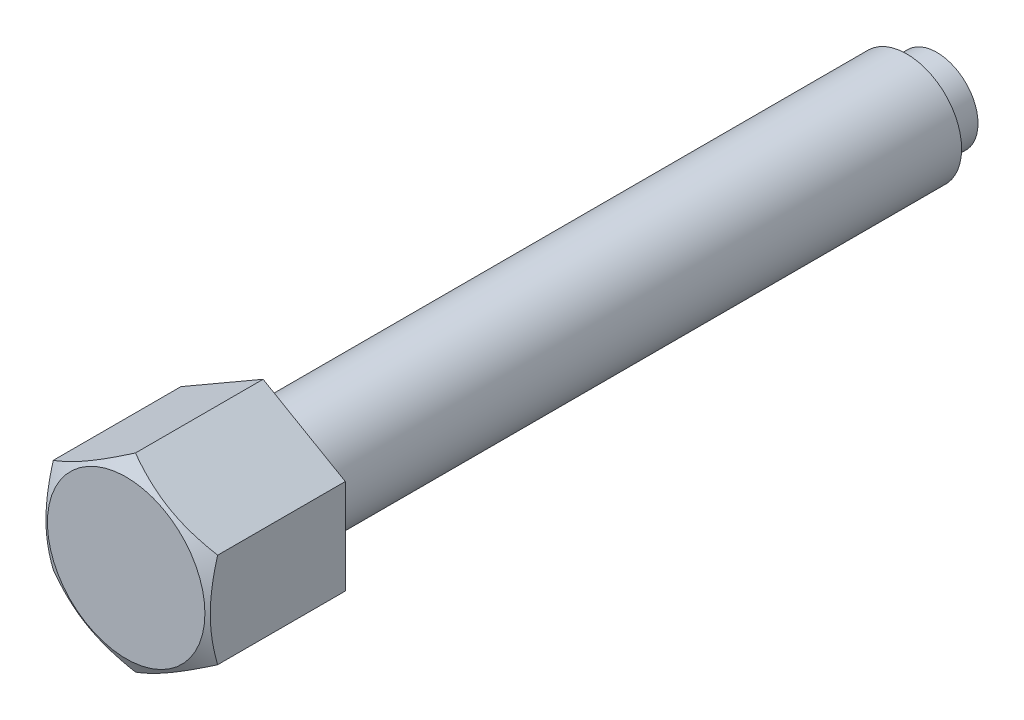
ISO-10303-21;
HEADER;
FILE_DESCRIPTION(('STEP AP214'),'2;1');
FILE_NAME('part.step','',(''),(''),'','','');
FILE_SCHEMA(('AUTOMOTIVE_DESIGN { 1 0 10303 214 1 1 1 1 }'));
ENDSEC;
DATA;
#1=APPLICATION_CONTEXT('core data for automotive mechanical design processes');
#2=APPLICATION_PROTOCOL_DEFINITION('international standard','automotive_design',2000,#1);
#3=PRODUCT_CONTEXT('',#1,'mechanical');
#4=PRODUCT('Part','Part','',(#3));
#5=PRODUCT_RELATED_PRODUCT_CATEGORY('part','',(#4));
#6=PRODUCT_DEFINITION_FORMATION('','',#4);
#7=PRODUCT_DEFINITION_CONTEXT('part definition',#1,'design');
#8=PRODUCT_DEFINITION('design','',#6,#7);
#9=PRODUCT_DEFINITION_SHAPE('','',#8);
#10=(LENGTH_UNIT() NAMED_UNIT(*) SI_UNIT(.MILLI.,.METRE.));
#11=(NAMED_UNIT(*) PLANE_ANGLE_UNIT() SI_UNIT($,.RADIAN.));
#12=(NAMED_UNIT(*) SI_UNIT($,.STERADIAN.) SOLID_ANGLE_UNIT());
#13=UNCERTAINTY_MEASURE_WITH_UNIT(LENGTH_MEASURE(1.E-05),#10,'distance_accuracy_value','');
#14=(GEOMETRIC_REPRESENTATION_CONTEXT(3) GLOBAL_UNCERTAINTY_ASSIGNED_CONTEXT((#13)) GLOBAL_UNIT_ASSIGNED_CONTEXT((#10,
#11,#12)) REPRESENTATION_CONTEXT('',''));
#15=CARTESIAN_POINT('',(0.,0.,0.));
#16=DIRECTION('',(0.,0.,1.));
#17=DIRECTION('',(1.,0.,0.));
#18=AXIS2_PLACEMENT_3D('',#15,#16,#17);
#19=CARTESIAN_POINT('',(0.,13.856406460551,100.));
#20=DIRECTION('',(-0.5,-0.86602540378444,0.));
#21=DIRECTION('',(0.86602540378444,-0.5,0.));
#22=AXIS2_PLACEMENT_3D('',#19,#20,#21);
#23=PLANE('',#22);
#24=CARTESIAN_POINT('',(12.0002,6.92808776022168,118.639461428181));
#25=CARTESIAN_POINT('',(11.7364142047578,7.08038456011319,118.727375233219));
#26=CARTESIAN_POINT('',(11.4716448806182,7.23324920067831,118.811298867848));
#27=CARTESIAN_POINT('',(10.9399829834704,7.54020434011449,118.970058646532));
#28=CARTESIAN_POINT('',(10.6730897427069,7.69429522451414,119.044891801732));
#29=CARTESIAN_POINT('',(9.868109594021,8.15905073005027,119.254307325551));
#30=CARTESIAN_POINT('',(9.32684492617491,8.47155003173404,119.373421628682));
#31=CARTESIAN_POINT('',(8.51686717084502,8.93919090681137,119.513093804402));
#32=CARTESIAN_POINT('',(8.25057389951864,9.09293539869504,119.552881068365));
#33=CARTESIAN_POINT('',(7.71675440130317,9.40113622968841,119.619601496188));
#34=CARTESIAN_POINT('',(7.44922815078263,9.55559258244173,119.646534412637));
#35=CARTESIAN_POINT('',(6.91372963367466,9.86476279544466,119.686856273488));
#36=CARTESIAN_POINT('',(6.64575827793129,10.0194761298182,119.700261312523));
#37=CARTESIAN_POINT('',(6.10956726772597,10.3290461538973,119.713241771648));
#38=CARTESIAN_POINT('',(5.84134762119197,10.4839028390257,119.712817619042));
#39=CARTESIAN_POINT('',(5.3399106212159,10.7734076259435,119.699104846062));
#40=CARTESIAN_POINT('',(5.10665750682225,10.908076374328,119.687488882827));
#41=CARTESIAN_POINT('',(4.64068775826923,11.1771041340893,119.654016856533));
#42=CARTESIAN_POINT('',(4.40797116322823,11.3114631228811,119.632160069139));
#43=CARTESIAN_POINT('',(3.94320092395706,11.5797983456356,119.578587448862));
#44=CARTESIAN_POINT('',(3.711147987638,11.7137741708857,119.546863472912));
#45=CARTESIAN_POINT('',(3.24813003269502,11.9810977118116,119.474113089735));
#46=CARTESIAN_POINT('',(3.01716508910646,12.1144453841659,119.433086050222));
#47=CARTESIAN_POINT('',(2.31605804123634,12.5192297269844,119.295013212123));
#48=CARTESIAN_POINT('',(1.84794625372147,12.789494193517,119.184199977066));
#49=CARTESIAN_POINT('',(0.918702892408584,13.3259930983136,118.932699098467));
#50=CARTESIAN_POINT('',(0.457559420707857,13.5922344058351,118.792070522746));
#51=CARTESIAN_POINT('',(-0.000199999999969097,13.8565219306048,118.639461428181));
#52=B_SPLINE_CURVE_WITH_KNOTS('',3,(#24,#25,#26,#27,#28,#29,#30,#31,#32,#33,#34,#35,#36,#37,#38,
#39,#40,#41,#42,#43,#44,#45,#46,#47,#48,#49,#50,#51),.UNSPECIFIED.,.F.,.F.,(4,2,2,2,2,2,2,2,2,2,
2,2,2,4),(0.,0.951004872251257,1.90232158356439,3.8090046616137,4.73894551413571,
5.6689042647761,6.59775529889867,7.52657763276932,8.33514643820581,9.14377244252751,
9.95306755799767,10.7624176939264,12.4167102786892,14.0677556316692),.UNSPECIFIED.);
#53=CARTESIAN_POINT('',(12.,6.92820323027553,118.639528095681));
#54=VERTEX_POINT('',#53);
#55=CARTESIAN_POINT('',(0.,13.856406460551,118.639528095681));
#56=VERTEX_POINT('',#55);
#57=EDGE_CURVE('E30',#54,#56,#52,.T.);
#58=ORIENTED_EDGE('',*,*,#57,.F.);
#59=DIRECTION('',(0.,0.,1.));
#60=VECTOR('',#59,1.);
#61=CARTESIAN_POINT('',(12.,6.92820323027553,100.));
#62=LINE('',#61,#60);
#63=CARTESIAN_POINT('',(12.,6.92820323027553,100.));
#64=VERTEX_POINT('',#63);
#65=EDGE_CURVE('E100',#64,#54,#62,.T.);
#66=ORIENTED_EDGE('',*,*,#65,.F.);
#67=DIRECTION('',(0.86602540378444,-0.5,0.));
#68=VECTOR('',#67,1.);
#69=CARTESIAN_POINT('',(0.,13.856406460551,100.));
#70=LINE('',#69,#68);
#71=CARTESIAN_POINT('',(0.,13.856406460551,100.));
#72=VERTEX_POINT('',#71);
#73=EDGE_CURVE('E38',#72,#64,#70,.T.);
#74=ORIENTED_EDGE('',*,*,#73,.F.);
#75=DIRECTION('',(0.,0.,1.));
#76=VECTOR('',#75,1.);
#77=CARTESIAN_POINT('',(0.,13.856406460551,100.));
#78=LINE('',#77,#76);
#79=EDGE_CURVE('E88',#72,#56,#78,.T.);
#80=ORIENTED_EDGE('',*,*,#79,.T.);
#81=EDGE_LOOP('',(#58,#66,#74,#80));
#82=FACE_BOUND('',#81,.T.);
#83=ADVANCED_FACE('F15',(#82),#23,.F.);
#84=CARTESIAN_POINT('',(12.,6.92820323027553,100.));
#85=DIRECTION('',(-1.,0.,0.));
#86=DIRECTION('',(0.,0.,1.));
#87=AXIS2_PLACEMENT_3D('',#84,#85,#86);
#88=PLANE('',#87);
#89=CARTESIAN_POINT('',(12.,-18.5484293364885,113.884865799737));
#90=CARTESIAN_POINT('',(12.,-18.2866339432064,114.011768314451));
#91=CARTESIAN_POINT('',(12.,-18.0245296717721,114.138033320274));
#92=CARTESIAN_POINT('',(12.,-17.4996388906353,114.389143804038));
#93=CARTESIAN_POINT('',(12.,-17.2368523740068,114.513989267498));
#94=CARTESIAN_POINT('',(12.,-16.4473018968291,114.886212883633));
#95=CARTESIAN_POINT('',(12.,-15.9194254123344,115.131240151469));
#96=CARTESIAN_POINT('',(12.,-14.8572168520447,115.614864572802));
#97=CARTESIAN_POINT('',(12.,-14.3228652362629,115.85341891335));
#98=CARTESIAN_POINT('',(12.,-13.2498908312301,116.320686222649));
#99=CARTESIAN_POINT('',(12.,-12.7112682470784,116.549399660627));
#100=CARTESIAN_POINT('',(12.,-11.6117569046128,117.001424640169));
#101=CARTESIAN_POINT('',(12.,-11.050702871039,117.224336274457));
#102=CARTESIAN_POINT('',(12.,-9.9220041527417,117.653139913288));
#103=CARTESIAN_POINT('',(12.,-9.3543587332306,117.859029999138));
#104=CARTESIAN_POINT('',(12.,-8.21267534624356,118.248337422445));
#105=CARTESIAN_POINT('',(12.,-7.63865320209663,118.431800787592));
#106=CARTESIAN_POINT('',(12.,-6.48232069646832,118.770337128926));
#107=CARTESIAN_POINT('',(12.,-5.90001302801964,118.925419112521));
#108=CARTESIAN_POINT('',(12.,-5.02184531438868,119.130691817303));
#109=CARTESIAN_POINT('',(12.,-4.72913069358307,119.194422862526));
#110=CARTESIAN_POINT('',(12.,-4.14171299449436,119.312002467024));
#111=CARTESIAN_POINT('',(12.,-3.84700995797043,119.365851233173));
#112=CARTESIAN_POINT('',(12.,-3.25582280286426,119.46271208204));
#113=CARTESIAN_POINT('',(12.,-2.95933870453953,119.505724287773));
#114=CARTESIAN_POINT('',(12.,-2.36490905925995,119.580051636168));
#115=CARTESIAN_POINT('',(12.,-2.06696356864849,119.611367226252));
#116=CARTESIAN_POINT('',(12.,-1.47389072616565,119.661290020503));
#117=CARTESIAN_POINT('',(12.,-1.17877687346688,119.680056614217));
#118=CARTESIAN_POINT('',(12.,-0.58802085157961,119.705097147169));
#119=CARTESIAN_POINT('',(12.,-0.292378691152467,119.711371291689));
#120=CARTESIAN_POINT('',(12.,0.298907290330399,119.711277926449));
#121=CARTESIAN_POINT('',(12.,0.59455111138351,119.704910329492));
#122=CARTESIAN_POINT('',(12.,1.1853091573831,119.679687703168));
#123=CARTESIAN_POINT('',(12.,1.48042335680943,119.660832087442));
#124=CARTESIAN_POINT('',(12.,2.19154152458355,119.60074825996));
#125=CARTESIAN_POINT('',(12.,2.60704492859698,119.553491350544));
#126=CARTESIAN_POINT('',(12.,3.43492981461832,119.436811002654));
#127=CARTESIAN_POINT('',(12.,3.84731085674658,119.367384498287));
#128=CARTESIAN_POINT('',(12.,4.66857069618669,119.208834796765));
#129=CARTESIAN_POINT('',(12.,5.07744646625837,119.119696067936));
#130=CARTESIAN_POINT('',(12.,5.89107791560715,118.924438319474));
#131=CARTESIAN_POINT('',(12.,6.29583366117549,118.81831957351));
#132=CARTESIAN_POINT('',(12.,7.11010566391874,118.589177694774));
#133=CARTESIAN_POINT('',(12.,7.51953121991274,118.465834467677));
#134=CARTESIAN_POINT('',(12.,8.33434825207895,118.206541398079));
#135=CARTESIAN_POINT('',(12.,8.73973970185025,118.070591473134));
#136=CARTESIAN_POINT('',(12.,9.54669145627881,117.788231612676));
#137=CARTESIAN_POINT('',(12.,9.94825301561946,117.641825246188));
#138=CARTESIAN_POINT('',(12.,10.7480576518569,117.340261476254));
#139=CARTESIAN_POINT('',(12.,11.1463007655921,117.185104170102));
#140=CARTESIAN_POINT('',(12.,12.0779209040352,116.812229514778));
#141=CARTESIAN_POINT('',(12.,12.6101022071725,116.591529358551));
#142=CARTESIAN_POINT('',(12.,13.6700144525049,116.139659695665));
#143=CARTESIAN_POINT('',(12.,14.1977451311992,115.908489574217));
#144=CARTESIAN_POINT('',(12.,15.2495749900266,115.437755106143));
#145=CARTESIAN_POINT('',(12.,15.7736733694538,115.198188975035));
#146=CARTESIAN_POINT('',(12.,16.8187259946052,114.712337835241));
#147=CARTESIAN_POINT('',(12.,17.3396803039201,114.466052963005));
#148=CARTESIAN_POINT('',(12.,18.3795111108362,113.967744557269));
#149=CARTESIAN_POINT('',(12.,18.8983848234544,113.715715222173));
#150=CARTESIAN_POINT('',(12.,19.9339150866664,113.20714298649));
#151=CARTESIAN_POINT('',(12.,20.4505716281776,112.950600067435));
#152=CARTESIAN_POINT('',(12.,21.48194150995,112.433799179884));
#153=CARTESIAN_POINT('',(12.,21.9966550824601,112.173541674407));
#154=CARTESIAN_POINT('',(12.,23.0244813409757,111.649882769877));
#155=CARTESIAN_POINT('',(12.,23.5375940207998,111.386481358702));
#156=CARTESIAN_POINT('',(12.,24.9902885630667,110.636010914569));
#157=CARTESIAN_POINT('',(12.,25.9282531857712,110.145811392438));
#158=CARTESIAN_POINT('',(12.,27.8006989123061,109.158743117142));
#159=CARTESIAN_POINT('',(12.,28.7351798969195,108.661874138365));
#160=CARTESIAN_POINT('',(12.,30.5991486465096,107.664227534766));
#161=CARTESIAN_POINT('',(12.,31.5286430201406,107.163462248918));
#162=CARTESIAN_POINT('',(12.,32.9212375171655,106.409335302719));
#163=CARTESIAN_POINT('',(12.,33.3851490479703,106.15746978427));
#164=CARTESIAN_POINT('',(12.,34.312484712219,105.652844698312));
#165=CARTESIAN_POINT('',(12.,34.7759088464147,105.400085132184));
#166=CARTESIAN_POINT('',(12.,35.2391167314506,105.146929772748));
#167=B_SPLINE_CURVE_WITH_KNOTS('',3,(#89,#90,#91,#92,#93,#94,#95,#96,#97,#98,#99,#100,#101,#102,
#103,#104,#105,#106,#107,#108,#109,#110,#111,#112,#113,#114,#115,#116,#117,#118,#119,#120,#121,
#122,#123,#124,#125,#126,#127,#128,#129,#130,#131,#132,#133,#134,#135,#136,#137,#138,#139,#140,
#141,#142,#143,#144,#145,#146,#147,#148,#149,#150,#151,#152,#153,#154,#155,#156,#157,#158,#159,
#160,#161,#162,#163,#164,#165,#166),.UNSPECIFIED.,.F.,.F.,(4,2,2,2,2,2,2,2,2,2,2,2,2,2,2,2,2,2,
2,2,2,2,2,2,2,2,2,2,2,2,2,2,2,2,2,2,2,2,4),(0.,0.87279258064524,1.74559405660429,
3.49145851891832,5.24693197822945,7.00232164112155,8.81325436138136,10.6243909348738,
12.4317456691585,14.2385258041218,15.1371025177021,16.035660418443,16.9342081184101,
17.8327214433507,18.7195939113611,19.6064518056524,20.4933158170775,21.3802214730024,
22.6340727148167,23.888097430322,25.1431137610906,26.3981098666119,27.6806706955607,
28.9632399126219,30.2453734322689,31.5274926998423,33.2557306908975,34.9840702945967,
36.7127794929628,38.4414536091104,40.1719585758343,41.9024706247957,43.6327688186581,
45.3630736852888,48.5380384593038,51.7131109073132,54.8805146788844,56.4641336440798,
58.0477501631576),.UNSPECIFIED.);
#168=CARTESIAN_POINT('',(12.,-6.92820323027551,118.639528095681));
#169=VERTEX_POINT('',#168);
#170=EDGE_CURVE('E147',#169,#54,#167,.T.);
#171=ORIENTED_EDGE('',*,*,#170,.F.);
#172=DIRECTION('',(0.,0.,1.));
#173=VECTOR('',#172,1.);
#174=CARTESIAN_POINT('',(12.,-6.9282032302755,100.));
#175=LINE('',#174,#173);
#176=CARTESIAN_POINT('',(12.,-6.9282032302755,100.));
#177=VERTEX_POINT('',#176);
#178=EDGE_CURVE('E97',#177,#169,#175,.T.);
#179=ORIENTED_EDGE('',*,*,#178,.F.);
#180=DIRECTION('',(0.,-1.,0.));
#181=VECTOR('',#180,1.);
#182=CARTESIAN_POINT('',(12.,6.92820323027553,100.));
#183=LINE('',#182,#181);
#184=EDGE_CURVE('E162',#64,#177,#183,.T.);
#185=ORIENTED_EDGE('',*,*,#184,.F.);
#186=ORIENTED_EDGE('',*,*,#65,.T.);
#187=EDGE_LOOP('',(#171,#179,#185,#186));
#188=FACE_BOUND('',#187,.T.);
#189=ADVANCED_FACE('F126',(#188),#88,.F.);
#190=CARTESIAN_POINT('',(0.,-13.856406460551,100.));
#191=DIRECTION('',(0.5,-0.866025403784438,0.));
#192=DIRECTION('',(0.866025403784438,0.5,0.));
#193=AXIS2_PLACEMENT_3D('',#190,#191,#192);
#194=PLANE('',#193);
#195=ORIENTED_EDGE('',*,*,#178,.T.);
#196=CARTESIAN_POINT('',(12.0002,-6.92808776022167,118.639461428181));
#197=CARTESIAN_POINT('',(11.7364142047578,-7.08038456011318,118.727375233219));
#198=CARTESIAN_POINT('',(11.4716448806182,-7.2332492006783,118.811298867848));
#199=CARTESIAN_POINT('',(10.9399829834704,-7.54020434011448,118.970058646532));
#200=CARTESIAN_POINT('',(10.6730897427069,-7.69429522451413,119.044891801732));
#201=CARTESIAN_POINT('',(9.868109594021,-8.15905073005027,119.254307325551));
#202=CARTESIAN_POINT('',(9.32684492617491,-8.47155003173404,119.373421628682));
#203=CARTESIAN_POINT('',(8.51686717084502,-8.93919090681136,119.513093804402));
#204=CARTESIAN_POINT('',(8.25057389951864,-9.09293539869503,119.552881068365));
#205=CARTESIAN_POINT('',(7.71675440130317,-9.4011362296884,119.619601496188));
#206=CARTESIAN_POINT('',(7.44922815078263,-9.55559258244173,119.646534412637));
#207=CARTESIAN_POINT('',(6.91372963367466,-9.86476279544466,119.686856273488));
#208=CARTESIAN_POINT('',(6.64575827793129,-10.0194761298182,119.700261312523));
#209=CARTESIAN_POINT('',(6.10956726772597,-10.3290461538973,119.713241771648));
#210=CARTESIAN_POINT('',(5.84134762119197,-10.4839028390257,119.712817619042));
#211=CARTESIAN_POINT('',(5.3399106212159,-10.7734076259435,119.699104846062));
#212=CARTESIAN_POINT('',(5.10665750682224,-10.908076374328,119.687488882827));
#213=CARTESIAN_POINT('',(4.64068775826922,-11.1771041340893,119.654016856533));
#214=CARTESIAN_POINT('',(4.40797116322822,-11.3114631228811,119.632160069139));
#215=CARTESIAN_POINT('',(3.94320092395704,-11.5797983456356,119.578587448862));
#216=CARTESIAN_POINT('',(3.71114798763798,-11.7137741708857,119.546863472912));
#217=CARTESIAN_POINT('',(3.248130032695,-11.9810977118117,119.474113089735));
#218=CARTESIAN_POINT('',(3.01716508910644,-12.1144453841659,119.433086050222));
#219=CARTESIAN_POINT('',(2.31605804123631,-12.5192297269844,119.295013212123));
#220=CARTESIAN_POINT('',(1.84794625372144,-12.789494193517,119.184199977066));
#221=CARTESIAN_POINT('',(0.918702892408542,-13.3259930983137,118.932699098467));
#222=CARTESIAN_POINT('',(0.457559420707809,-13.5922344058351,118.792070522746));
#223=CARTESIAN_POINT('',(-0.000200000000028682,-13.8565219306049,118.639461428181));
#224=B_SPLINE_CURVE_WITH_KNOTS('',3,(#196,#197,#198,#199,#200,#201,#202,#203,#204,#205,#206,
#207,#208,#209,#210,#211,#212,#213,#214,#215,#216,#217,#218,#219,#220,#221,#222,#223),
.UNSPECIFIED.,.F.,.F.,(4,2,2,2,2,2,2,2,2,2,2,2,2,4),(0.,0.951004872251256,1.90232158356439,
3.8090046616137,4.73894551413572,5.66890426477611,6.59775529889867,7.52657763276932,
8.33514643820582,9.14377244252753,9.9530675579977,10.7624176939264,12.4167102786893,
14.0677556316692),.UNSPECIFIED.);
#225=CARTESIAN_POINT('',(0.,-13.856406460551,118.639528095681));
#226=VERTEX_POINT('',#225);
#227=EDGE_CURVE('E173',#169,#226,#224,.T.);
#228=ORIENTED_EDGE('',*,*,#227,.T.);
#229=DIRECTION('',(0.,0.,1.));
#230=VECTOR('',#229,1.);
#231=CARTESIAN_POINT('',(0.,-13.856406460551,100.));
#232=LINE('',#231,#230);
#233=CARTESIAN_POINT('',(0.,-13.856406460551,100.));
#234=VERTEX_POINT('',#233);
#235=EDGE_CURVE('E90',#234,#226,#232,.T.);
#236=ORIENTED_EDGE('',*,*,#235,.F.);
#237=DIRECTION('',(0.866025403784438,0.5,0.));
#238=VECTOR('',#237,1.);
#239=CARTESIAN_POINT('',(0.,-13.856406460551,100.));
#240=LINE('',#239,#238);
#241=EDGE_CURVE('E159',#234,#177,#240,.T.);
#242=ORIENTED_EDGE('',*,*,#241,.T.);
#243=EDGE_LOOP('',(#195,#228,#236,#242));
#244=FACE_BOUND('',#243,.T.);
#245=ADVANCED_FACE('F131',(#244),#194,.T.);
#246=CARTESIAN_POINT('',(0.,-13.856406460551,100.));
#247=DIRECTION('',(0.5,0.866025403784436,0.));
#248=DIRECTION('',(-0.866025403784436,0.5,0.));
#249=AXIS2_PLACEMENT_3D('',#246,#247,#248);
#250=PLANE('',#249);
#251=CARTESIAN_POINT('',(-12.0002,-6.92808776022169,118.639461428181));
#252=CARTESIAN_POINT('',(-11.7364142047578,-7.0803845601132,118.727375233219));
#253=CARTESIAN_POINT('',(-11.4716448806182,-7.23324920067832,118.811298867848));
#254=CARTESIAN_POINT('',(-10.9399829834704,-7.5402043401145,118.970058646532));
#255=CARTESIAN_POINT('',(-10.6730897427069,-7.69429522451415,119.044891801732));
#256=CARTESIAN_POINT('',(-9.868109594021,-8.15905073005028,119.254307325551));
#257=CARTESIAN_POINT('',(-9.32684492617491,-8.47155003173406,119.373421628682));
#258=CARTESIAN_POINT('',(-8.51686717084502,-8.93919090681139,119.513093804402));
#259=CARTESIAN_POINT('',(-8.25057389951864,-9.09293539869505,119.552881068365));
#260=CARTESIAN_POINT('',(-7.71675440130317,-9.40113622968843,119.619601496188));
#261=CARTESIAN_POINT('',(-7.44922815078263,-9.55559258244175,119.646534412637));
#262=CARTESIAN_POINT('',(-6.91372963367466,-9.86476279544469,119.686856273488));
#263=CARTESIAN_POINT('',(-6.64575827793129,-10.0194761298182,119.700261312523));
#264=CARTESIAN_POINT('',(-6.10956726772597,-10.3290461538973,119.713241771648));
#265=CARTESIAN_POINT('',(-5.84134762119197,-10.4839028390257,119.712817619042));
#266=CARTESIAN_POINT('',(-5.3399106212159,-10.7734076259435,119.699104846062));
#267=CARTESIAN_POINT('',(-5.10665750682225,-10.908076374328,119.687488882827));
#268=CARTESIAN_POINT('',(-4.64068775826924,-11.1771041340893,119.654016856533));
#269=CARTESIAN_POINT('',(-4.40797116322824,-11.3114631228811,119.632160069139));
#270=CARTESIAN_POINT('',(-3.94320092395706,-11.5797983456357,119.578587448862));
#271=CARTESIAN_POINT('',(-3.711147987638,-11.7137741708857,119.546863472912));
#272=CARTESIAN_POINT('',(-3.24813003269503,-11.9810977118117,119.474113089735));
#273=CARTESIAN_POINT('',(-3.01716508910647,-12.1144453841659,119.433086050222));
#274=CARTESIAN_POINT('',(-2.31605804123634,-12.5192297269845,119.295013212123));
#275=CARTESIAN_POINT('',(-1.84794625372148,-12.789494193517,119.184199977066));
#276=CARTESIAN_POINT('',(-0.918702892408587,-13.3259930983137,118.932699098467));
#277=CARTESIAN_POINT('',(-0.45755942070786,-13.5922344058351,118.792070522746));
#278=CARTESIAN_POINT('',(0.000199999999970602,-13.8565219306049,118.639461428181));
#279=B_SPLINE_CURVE_WITH_KNOTS('',3,(#251,#252,#253,#254,#255,#256,#257,#258,#259,#260,#261,
#262,#263,#264,#265,#266,#267,#268,#269,#270,#271,#272,#273,#274,#275,#276,#277,#278),
.UNSPECIFIED.,.F.,.F.,(4,2,2,2,2,2,2,2,2,2,2,2,2,4),(0.,0.951004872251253,1.90232158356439,
3.8090046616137,4.73894551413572,5.66890426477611,6.59775529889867,7.52657763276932,
8.33514643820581,9.14377244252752,9.95306755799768,10.7624176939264,12.4167102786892,
14.0677556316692),.UNSPECIFIED.);
#280=CARTESIAN_POINT('',(-12.,-6.92820323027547,118.639528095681));
#281=VERTEX_POINT('',#280);
#282=EDGE_CURVE('E82',#281,#226,#279,.T.);
#283=ORIENTED_EDGE('',*,*,#282,.F.);
#284=DIRECTION('',(0.,0.,1.));
#285=VECTOR('',#284,1.);
#286=CARTESIAN_POINT('',(-12.,-6.92820323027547,100.));
#287=LINE('',#286,#285);
#288=CARTESIAN_POINT('',(-12.,-6.92820323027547,100.));
#289=VERTEX_POINT('',#288);
#290=EDGE_CURVE('E81',#289,#281,#287,.T.);
#291=ORIENTED_EDGE('',*,*,#290,.F.);
#292=DIRECTION('',(-0.866025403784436,0.5,0.));
#293=VECTOR('',#292,1.);
#294=CARTESIAN_POINT('',(0.,-13.856406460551,100.));
#295=LINE('',#294,#293);
#296=EDGE_CURVE('E156',#234,#289,#295,.T.);
#297=ORIENTED_EDGE('',*,*,#296,.F.);
#298=ORIENTED_EDGE('',*,*,#235,.T.);
#299=EDGE_LOOP('',(#283,#291,#297,#298));
#300=FACE_BOUND('',#299,.T.);
#301=ADVANCED_FACE('F171',(#300),#250,.F.);
#302=CARTESIAN_POINT('',(-12.,6.92820323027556,100.));
#303=DIRECTION('',(-1.,0.,0.));
#304=DIRECTION('',(0.,0.,1.));
#305=AXIS2_PLACEMENT_3D('',#302,#303,#304);
#306=PLANE('',#305);
#307=ORIENTED_EDGE('',*,*,#290,.T.);
#308=CARTESIAN_POINT('',(-12.,-18.5484293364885,113.884865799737));
#309=CARTESIAN_POINT('',(-12.,-18.2866339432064,114.011768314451));
#310=CARTESIAN_POINT('',(-12.,-18.0245296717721,114.138033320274));
#311=CARTESIAN_POINT('',(-12.,-17.4996388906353,114.389143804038));
#312=CARTESIAN_POINT('',(-12.,-17.2368523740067,114.513989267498));
#313=CARTESIAN_POINT('',(-12.,-16.4473018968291,114.886212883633));
#314=CARTESIAN_POINT('',(-12.,-15.9194254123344,115.131240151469));
#315=CARTESIAN_POINT('',(-12.,-14.8572168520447,115.614864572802));
#316=CARTESIAN_POINT('',(-12.,-14.3228652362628,115.853418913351));
#317=CARTESIAN_POINT('',(-12.,-13.24989083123,116.320686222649));
#318=CARTESIAN_POINT('',(-12.,-12.7112682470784,116.549399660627));
#319=CARTESIAN_POINT('',(-12.,-11.6117569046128,117.001424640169));
#320=CARTESIAN_POINT('',(-12.,-11.050702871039,117.224336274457));
#321=CARTESIAN_POINT('',(-12.,-9.92200415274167,117.653139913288));
#322=CARTESIAN_POINT('',(-12.,-9.35435873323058,117.859029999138));
#323=CARTESIAN_POINT('',(-12.,-8.21267534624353,118.248337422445));
#324=CARTESIAN_POINT('',(-12.,-7.63865320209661,118.431800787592));
#325=CARTESIAN_POINT('',(-12.,-6.4823206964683,118.770337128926));
#326=CARTESIAN_POINT('',(-12.,-5.90001302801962,118.925419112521));
#327=CARTESIAN_POINT('',(-12.,-5.02184531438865,119.130691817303));
#328=CARTESIAN_POINT('',(-12.,-4.72913069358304,119.194422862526));
#329=CARTESIAN_POINT('',(-12.,-4.14171299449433,119.312002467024));
#330=CARTESIAN_POINT('',(-12.,-3.84700995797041,119.365851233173));
#331=CARTESIAN_POINT('',(-12.,-3.25582280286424,119.46271208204));
#332=CARTESIAN_POINT('',(-12.,-2.9593387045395,119.505724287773));
#333=CARTESIAN_POINT('',(-12.,-2.36490905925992,119.580051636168));
#334=CARTESIAN_POINT('',(-12.,-2.06696356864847,119.611367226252));
#335=CARTESIAN_POINT('',(-12.,-1.47389072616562,119.661290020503));
#336=CARTESIAN_POINT('',(-12.,-1.17877687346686,119.680056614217));
#337=CARTESIAN_POINT('',(-12.,-0.58802085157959,119.705097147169));
#338=CARTESIAN_POINT('',(-12.,-0.292378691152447,119.711371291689));
#339=CARTESIAN_POINT('',(-12.,0.298907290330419,119.711277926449));
#340=CARTESIAN_POINT('',(-12.,0.594551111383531,119.704910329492));
#341=CARTESIAN_POINT('',(-12.,1.18530915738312,119.679687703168));
#342=CARTESIAN_POINT('',(-12.,1.48042335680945,119.660832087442));
#343=CARTESIAN_POINT('',(-12.,2.19154152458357,119.60074825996));
#344=CARTESIAN_POINT('',(-12.,2.60704492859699,119.553491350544));
#345=CARTESIAN_POINT('',(-12.,3.43492981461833,119.436811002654));
#346=CARTESIAN_POINT('',(-12.,3.8473108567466,119.367384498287));
#347=CARTESIAN_POINT('',(-12.,4.6685706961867,119.208834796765));
#348=CARTESIAN_POINT('',(-12.,5.07744646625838,119.119696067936));
#349=CARTESIAN_POINT('',(-12.,5.89107791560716,118.924438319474));
#350=CARTESIAN_POINT('',(-12.,6.2958336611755,118.81831957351));
#351=CARTESIAN_POINT('',(-12.,7.11010566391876,118.589177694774));
#352=CARTESIAN_POINT('',(-12.,7.51953121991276,118.465834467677));
#353=CARTESIAN_POINT('',(-12.,8.33434825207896,118.206541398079));
#354=CARTESIAN_POINT('',(-12.,8.73973970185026,118.070591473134));
#355=CARTESIAN_POINT('',(-12.,9.54669145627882,117.788231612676));
#356=CARTESIAN_POINT('',(-12.,9.94825301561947,117.641825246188));
#357=CARTESIAN_POINT('',(-12.,10.7480576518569,117.340261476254));
#358=CARTESIAN_POINT('',(-12.,11.1463007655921,117.185104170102));
#359=CARTESIAN_POINT('',(-12.,12.0779209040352,116.812229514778));
#360=CARTESIAN_POINT('',(-12.,12.6101022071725,116.591529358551));
#361=CARTESIAN_POINT('',(-12.,13.670014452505,116.139659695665));
#362=CARTESIAN_POINT('',(-12.,14.1977451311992,115.908489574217));
#363=CARTESIAN_POINT('',(-12.,15.2495749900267,115.437755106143));
#364=CARTESIAN_POINT('',(-12.,15.7736733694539,115.198188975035));
#365=CARTESIAN_POINT('',(-12.,16.8187259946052,114.712337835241));
#366=CARTESIAN_POINT('',(-12.,17.3396803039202,114.466052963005));
#367=CARTESIAN_POINT('',(-12.,18.3795111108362,113.967744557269));
#368=CARTESIAN_POINT('',(-12.,18.8983848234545,113.715715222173));
#369=CARTESIAN_POINT('',(-12.,19.9339150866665,113.20714298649));
#370=CARTESIAN_POINT('',(-12.,20.4505716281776,112.950600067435));
#371=CARTESIAN_POINT('',(-12.,21.4819415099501,112.433799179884));
#372=CARTESIAN_POINT('',(-12.,21.9966550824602,112.173541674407));
#373=CARTESIAN_POINT('',(-12.,23.0244813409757,111.649882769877));
#374=CARTESIAN_POINT('',(-12.,23.5375940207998,111.386481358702));
#375=CARTESIAN_POINT('',(-12.,24.9902885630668,110.636010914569));
#376=CARTESIAN_POINT('',(-12.,25.9282531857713,110.145811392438));
#377=CARTESIAN_POINT('',(-12.,27.8006989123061,109.158743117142));
#378=CARTESIAN_POINT('',(-12.,28.7351798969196,108.661874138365));
#379=CARTESIAN_POINT('',(-12.,30.5991486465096,107.664227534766));
#380=CARTESIAN_POINT('',(-12.,31.5286430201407,107.163462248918));
#381=CARTESIAN_POINT('',(-12.,32.9212375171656,106.409335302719));
#382=CARTESIAN_POINT('',(-12.,33.3851490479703,106.15746978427));
#383=CARTESIAN_POINT('',(-12.,34.312484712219,105.652844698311));
#384=CARTESIAN_POINT('',(-12.,34.7759088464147,105.400085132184));
#385=CARTESIAN_POINT('',(-12.,35.2391167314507,105.146929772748));
#386=B_SPLINE_CURVE_WITH_KNOTS('',3,(#308,#309,#310,#311,#312,#313,#314,#315,#316,#317,#318,
#319,#320,#321,#322,#323,#324,#325,#326,#327,#328,#329,#330,#331,#332,#333,#334,#335,#336,#337,
#338,#339,#340,#341,#342,#343,#344,#345,#346,#347,#348,#349,#350,#351,#352,#353,#354,#355,#356,
#357,#358,#359,#360,#361,#362,#363,#364,#365,#366,#367,#368,#369,#370,#371,#372,#373,#374,#375,
#376,#377,#378,#379,#380,#381,#382,#383,#384,#385),.UNSPECIFIED.,.F.,.F.,(4,2,2,2,2,2,2,2,2,2,2,
2,2,2,2,2,2,2,2,2,2,2,2,2,2,2,2,2,2,2,2,2,2,2,2,2,2,2,4),(0.,0.872792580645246,1.7455940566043,
3.49145851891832,5.24693197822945,7.00232164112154,8.81325436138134,10.6243909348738,
12.4317456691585,14.2385258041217,15.1371025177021,16.035660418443,16.9342081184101,
17.8327214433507,18.7195939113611,19.6064518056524,20.4933158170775,21.3802214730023,
22.6340727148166,23.888097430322,25.1431137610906,26.3981098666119,27.6806706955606,
28.9632399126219,30.2453734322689,31.5274926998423,33.2557306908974,34.9840702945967,
36.7127794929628,38.4414536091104,40.1719585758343,41.9024706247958,43.6327688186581,
45.3630736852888,48.5380384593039,51.7131109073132,54.8805146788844,56.4641336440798,
58.0477501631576),.UNSPECIFIED.);
#387=CARTESIAN_POINT('',(-12.,6.92820323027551,118.639528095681));
#388=VERTEX_POINT('',#387);
#389=EDGE_CURVE('E69',#281,#388,#386,.T.);
#390=ORIENTED_EDGE('',*,*,#389,.T.);
#391=DIRECTION('',(0.,0.,1.));
#392=VECTOR('',#391,1.);
#393=CARTESIAN_POINT('',(-12.,6.92820323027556,100.));
#394=LINE('',#393,#392);
#395=CARTESIAN_POINT('',(-12.,6.92820323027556,100.));
#396=VERTEX_POINT('',#395);
#397=EDGE_CURVE('E79',#396,#388,#394,.T.);
#398=ORIENTED_EDGE('',*,*,#397,.F.);
#399=DIRECTION('',(0.,-1.,0.));
#400=VECTOR('',#399,1.);
#401=CARTESIAN_POINT('',(-12.,6.92820323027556,100.));
#402=LINE('',#401,#400);
#403=EDGE_CURVE('E154',#396,#289,#402,.T.);
#404=ORIENTED_EDGE('',*,*,#403,.T.);
#405=EDGE_LOOP('',(#307,#390,#398,#404));
#406=FACE_BOUND('',#405,.T.);
#407=ADVANCED_FACE('F77',(#406),#306,.T.);
#408=CARTESIAN_POINT('',(0.,13.856406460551,100.));
#409=DIRECTION('',(-0.5,0.866025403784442,0.));
#410=DIRECTION('',(-0.866025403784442,-0.5,0.));
#411=AXIS2_PLACEMENT_3D('',#408,#409,#410);
#412=PLANE('',#411);
#413=ORIENTED_EDGE('',*,*,#397,.T.);
#414=CARTESIAN_POINT('',(-12.0002,6.92808776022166,118.639461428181));
#415=CARTESIAN_POINT('',(-11.7364142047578,7.08038456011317,118.727375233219));
#416=CARTESIAN_POINT('',(-11.4716448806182,7.23324920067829,118.811298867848));
#417=CARTESIAN_POINT('',(-10.9399829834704,7.54020434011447,118.970058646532));
#418=CARTESIAN_POINT('',(-10.6730897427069,7.69429522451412,119.044891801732));
#419=CARTESIAN_POINT('',(-9.868109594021,8.15905073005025,119.254307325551));
#420=CARTESIAN_POINT('',(-9.32684492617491,8.47155003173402,119.373421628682));
#421=CARTESIAN_POINT('',(-8.51686717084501,8.93919090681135,119.513093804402));
#422=CARTESIAN_POINT('',(-8.25057389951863,9.09293539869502,119.552881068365));
#423=CARTESIAN_POINT('',(-7.71675440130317,9.40113622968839,119.619601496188));
#424=CARTESIAN_POINT('',(-7.44922815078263,9.55559258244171,119.646534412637));
#425=CARTESIAN_POINT('',(-6.91372963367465,9.86476279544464,119.686856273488));
#426=CARTESIAN_POINT('',(-6.64575827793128,10.0194761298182,119.700261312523));
#427=CARTESIAN_POINT('',(-6.10956726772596,10.3290461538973,119.713241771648));
#428=CARTESIAN_POINT('',(-5.84134762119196,10.4839028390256,119.712817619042));
#429=CARTESIAN_POINT('',(-5.33991062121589,10.7734076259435,119.699104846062));
#430=CARTESIAN_POINT('',(-5.10665750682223,10.908076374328,119.687488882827));
#431=CARTESIAN_POINT('',(-4.64068775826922,11.1771041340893,119.654016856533));
#432=CARTESIAN_POINT('',(-4.40797116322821,11.3114631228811,119.632160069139));
#433=CARTESIAN_POINT('',(-3.94320092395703,11.5797983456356,119.578587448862));
#434=CARTESIAN_POINT('',(-3.71114798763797,11.7137741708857,119.546863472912));
#435=CARTESIAN_POINT('',(-3.24813003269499,11.9810977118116,119.474113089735));
#436=CARTESIAN_POINT('',(-3.01716508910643,12.1144453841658,119.433086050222));
#437=CARTESIAN_POINT('',(-2.3160580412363,12.5192297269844,119.295013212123));
#438=CARTESIAN_POINT('',(-1.84794625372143,12.789494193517,119.184199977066));
#439=CARTESIAN_POINT('',(-0.918702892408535,13.3259930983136,118.932699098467));
#440=CARTESIAN_POINT('',(-0.457559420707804,13.5922344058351,118.792070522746));
#441=CARTESIAN_POINT('',(0.000200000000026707,13.8565219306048,118.639461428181));
#442=B_SPLINE_CURVE_WITH_KNOTS('',3,(#414,#415,#416,#417,#418,#419,#420,#421,#422,#423,#424,
#425,#426,#427,#428,#429,#430,#431,#432,#433,#434,#435,#436,#437,#438,#439,#440,#441),
.UNSPECIFIED.,.F.,.F.,(4,2,2,2,2,2,2,2,2,2,2,2,2,4),(0.,0.951004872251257,1.9023215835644,
3.8090046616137,4.73894551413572,5.66890426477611,6.59775529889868,7.52657763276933,
8.33514643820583,9.14377244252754,9.9530675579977,10.7624176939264,12.4167102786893,
14.0677556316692),.UNSPECIFIED.);
#443=EDGE_CURVE('E66',#388,#56,#442,.T.);
#444=ORIENTED_EDGE('',*,*,#443,.T.);
#445=ORIENTED_EDGE('',*,*,#79,.F.);
#446=DIRECTION('',(-0.866025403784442,-0.5,0.));
#447=VECTOR('',#446,1.);
#448=CARTESIAN_POINT('',(0.,13.856406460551,100.));
#449=LINE('',#448,#447);
#450=EDGE_CURVE('E86',#72,#396,#449,.T.);
#451=ORIENTED_EDGE('',*,*,#450,.T.);
#452=EDGE_LOOP('',(#413,#444,#445,#451));
#453=FACE_BOUND('',#452,.T.);
#454=ADVANCED_FACE('F84',(#453),#412,.T.);
#455=CARTESIAN_POINT('',(0.,0.,12.));
#456=DIRECTION('',(0.,0.,1.));
#457=DIRECTION('',(1.,0.,0.));
#458=AXIS2_PLACEMENT_3D('',#455,#456,#457);
#459=SPHERICAL_SURFACE('',#458,12.);
#460=CARTESIAN_POINT('',(0.,0.,1.60769515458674));
#461=DIRECTION('',(0.,0.,1.));
#462=DIRECTION('',(1.,0.,0.));
#463=AXIS2_PLACEMENT_3D('',#460,#461,#462);
#464=CIRCLE('',#463,6.);
#465=CARTESIAN_POINT('',(6.,0.,1.60769515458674));
#466=VERTEX_POINT('',#465);
#467=EDGE_CURVE('E9',#466,#466,#464,.T.);
#468=ORIENTED_EDGE('',*,*,#467,.F.);
#469=EDGE_LOOP('',(#468));
#470=FACE_BOUND('',#469,.T.);
#471=ADVANCED_FACE('F17',(#470),#459,.T.);
#472=CARTESIAN_POINT('',(0.,0.,110.));
#473=DIRECTION('',(0.,0.,1.));
#474=DIRECTION('',(1.,0.,0.));
#475=AXIS2_PLACEMENT_3D('',#472,#473,#474);
#476=CYLINDRICAL_SURFACE('',#475,6.);
#477=ORIENTED_EDGE('',*,*,#467,.T.);
#478=EDGE_LOOP('',(#477));
#479=FACE_BOUND('',#478,.T.);
#480=CARTESIAN_POINT('',(0.,0.,6.));
#481=DIRECTION('',(0.,0.,1.));
#482=DIRECTION('',(1.,0.,0.));
#483=AXIS2_PLACEMENT_3D('',#480,#481,#482);
#484=CIRCLE('',#483,6.);
#485=CARTESIAN_POINT('',(6.,0.,6.));
#486=VERTEX_POINT('',#485);
#487=EDGE_CURVE('E23',#486,#486,#484,.T.);
#488=ORIENTED_EDGE('',*,*,#487,.F.);
#489=EDGE_LOOP('',(#488));
#490=FACE_BOUND('',#489,.T.);
#491=ADVANCED_FACE('F113',(#479,#490),#476,.T.);
#492=CARTESIAN_POINT('',(6.,0.,6.));
#493=DIRECTION('',(0.,0.,1.));
#494=DIRECTION('',(1.,0.,0.));
#495=AXIS2_PLACEMENT_3D('',#492,#493,#494);
#496=PLANE('',#495);
#497=CARTESIAN_POINT('',(0.,0.,6.));
#498=DIRECTION('',(0.,0.,1.));
#499=DIRECTION('',(1.,0.,0.));
#500=AXIS2_PLACEMENT_3D('',#497,#498,#499);
#501=CIRCLE('',#500,8.);
#502=CARTESIAN_POINT('',(8.,0.,6.));
#503=VERTEX_POINT('',#502);
#504=EDGE_CURVE('E106',#503,#503,#501,.T.);
#505=ORIENTED_EDGE('',*,*,#504,.F.);
#506=EDGE_LOOP('',(#505));
#507=FACE_BOUND('',#506,.T.);
#508=ORIENTED_EDGE('',*,*,#487,.T.);
#509=EDGE_LOOP('',(#508));
#510=FACE_BOUND('',#509,.T.);
#511=ADVANCED_FACE('F111',(#507,#510),#496,.F.);
#512=CARTESIAN_POINT('',(0.,0.,110.));
#513=DIRECTION('',(0.,0.,1.));
#514=DIRECTION('',(1.,0.,0.));
#515=AXIS2_PLACEMENT_3D('',#512,#513,#514);
#516=CYLINDRICAL_SURFACE('',#515,8.);
#517=CARTESIAN_POINT('',(0.,0.,100.));
#518=DIRECTION('',(0.,0.,1.));
#519=DIRECTION('',(1.,0.,0.));
#520=AXIS2_PLACEMENT_3D('',#517,#518,#519);
#521=CIRCLE('',#520,8.);
#522=CARTESIAN_POINT('',(8.,0.,100.));
#523=VERTEX_POINT('',#522);
#524=EDGE_CURVE('E103',#523,#523,#521,.T.);
#525=ORIENTED_EDGE('',*,*,#524,.F.);
#526=EDGE_LOOP('',(#525));
#527=FACE_BOUND('',#526,.T.);
#528=ORIENTED_EDGE('',*,*,#504,.T.);
#529=EDGE_LOOP('',(#528));
#530=FACE_BOUND('',#529,.T.);
#531=ADVANCED_FACE('F121',(#527,#530),#516,.T.);
#532=CARTESIAN_POINT('',(8.,0.,100.));
#533=DIRECTION('',(0.,0.,1.));
#534=DIRECTION('',(1.,0.,0.));
#535=AXIS2_PLACEMENT_3D('',#532,#533,#534);
#536=PLANE('',#535);
#537=ORIENTED_EDGE('',*,*,#450,.F.);
#538=ORIENTED_EDGE('',*,*,#73,.T.);
#539=ORIENTED_EDGE('',*,*,#184,.T.);
#540=ORIENTED_EDGE('',*,*,#241,.F.);
#541=ORIENTED_EDGE('',*,*,#296,.T.);
#542=ORIENTED_EDGE('',*,*,#403,.F.);
#543=EDGE_LOOP('',(#537,#538,#539,#540,#541,#542));
#544=FACE_BOUND('',#543,.T.);
#545=ORIENTED_EDGE('',*,*,#524,.T.);
#546=EDGE_LOOP('',(#545));
#547=FACE_BOUND('',#546,.T.);
#548=ADVANCED_FACE('F165',(#544,#547),#536,.F.);
#549=CARTESIAN_POINT('',(0.,0.,120.));
#550=DIRECTION('',(0.,0.,-1.));
#551=DIRECTION('',(-1.,0.,0.));
#552=AXIS2_PLACEMENT_3D('',#549,#550,#551);
#553=CONICAL_SURFACE('',#552,11.5,1.0471975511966);
#554=CARTESIAN_POINT('',(0.,0.,120.));
#555=DIRECTION('',(0.,0.,1.));
#556=DIRECTION('',(1.,0.,0.));
#557=AXIS2_PLACEMENT_3D('',#554,#555,#556);
#558=CIRCLE('',#557,11.5);
#559=CARTESIAN_POINT('',(11.5,0.,120.));
#560=VERTEX_POINT('',#559);
#561=EDGE_CURVE('E73',#560,#560,#558,.T.);
#562=ORIENTED_EDGE('',*,*,#561,.F.);
#563=EDGE_LOOP('',(#562));
#564=FACE_BOUND('',#563,.T.);
#565=ORIENTED_EDGE('',*,*,#57,.T.);
#566=ORIENTED_EDGE('',*,*,#443,.F.);
#567=ORIENTED_EDGE('',*,*,#389,.F.);
#568=ORIENTED_EDGE('',*,*,#282,.T.);
#569=ORIENTED_EDGE('',*,*,#227,.F.);
#570=ORIENTED_EDGE('',*,*,#170,.T.);
#571=EDGE_LOOP('',(#565,#566,#567,#568,#569,#570));
#572=FACE_BOUND('',#571,.T.);
#573=ADVANCED_FACE('F68',(#564,#572),#553,.T.);
#574=CARTESIAN_POINT('',(0.,0.,120.));
#575=DIRECTION('',(0.,0.,1.));
#576=DIRECTION('',(1.,0.,0.));
#577=AXIS2_PLACEMENT_3D('',#574,#575,#576);
#578=PLANE('',#577);
#579=ORIENTED_EDGE('',*,*,#561,.T.);
#580=EDGE_LOOP('',(#579));
#581=FACE_BOUND('',#580,.T.);
#582=ADVANCED_FACE('F197',(#581),#578,.T.);
#583=CLOSED_SHELL('',(#83,#189,#245,#301,#407,#454,#471,#491,#511,#531,#548,#573,#582));
#584=MANIFOLD_SOLID_BREP('B1',#583);
#585=ADVANCED_BREP_SHAPE_REPRESENTATION('',(#18,#584),#14);
#586=SHAPE_DEFINITION_REPRESENTATION(#9,#585);
ENDSEC;
END-ISO-10303-21;
